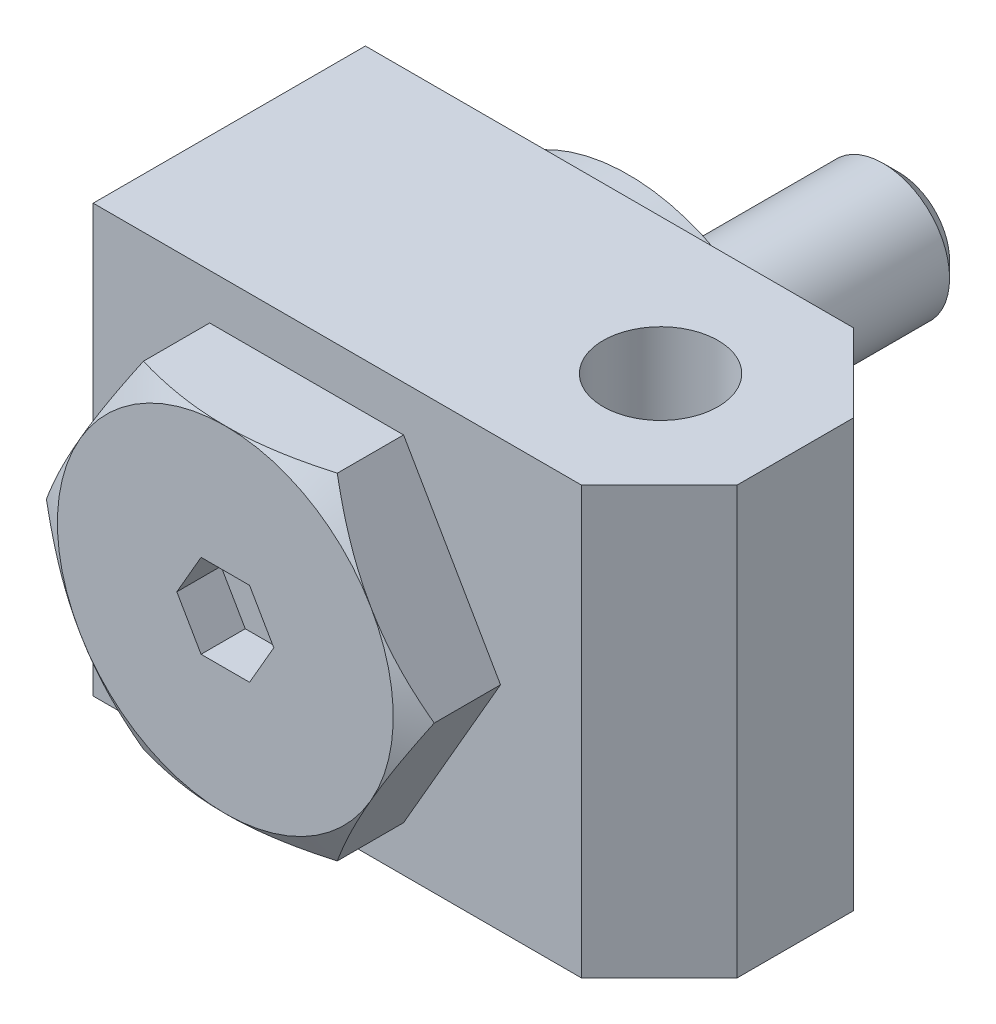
ISO-10303-21;
HEADER;
FILE_DESCRIPTION(('STEP AP214'),'2;1');
FILE_NAME('part.step','',(''),(''),'','','');
FILE_SCHEMA(('AUTOMOTIVE_DESIGN { 1 0 10303 214 1 1 1 1 }'));
ENDSEC;
DATA;
#1=APPLICATION_CONTEXT('core data for automotive mechanical design processes');
#2=APPLICATION_PROTOCOL_DEFINITION('international standard','automotive_design',2000,#1);
#3=PRODUCT_CONTEXT('',#1,'mechanical');
#4=PRODUCT('Part','Part','',(#3));
#5=PRODUCT_RELATED_PRODUCT_CATEGORY('part','',(#4));
#6=PRODUCT_DEFINITION_FORMATION('','',#4);
#7=PRODUCT_DEFINITION_CONTEXT('part definition',#1,'design');
#8=PRODUCT_DEFINITION('design','',#6,#7);
#9=PRODUCT_DEFINITION_SHAPE('','',#8);
#10=(LENGTH_UNIT() NAMED_UNIT(*) SI_UNIT(.MILLI.,.METRE.));
#11=(NAMED_UNIT(*) PLANE_ANGLE_UNIT() SI_UNIT($,.RADIAN.));
#12=(NAMED_UNIT(*) SI_UNIT($,.STERADIAN.) SOLID_ANGLE_UNIT());
#13=UNCERTAINTY_MEASURE_WITH_UNIT(LENGTH_MEASURE(1.E-05),#10,'distance_accuracy_value','');
#14=(GEOMETRIC_REPRESENTATION_CONTEXT(3) GLOBAL_UNCERTAINTY_ASSIGNED_CONTEXT((#13)) GLOBAL_UNIT_ASSIGNED_CONTEXT((#10,
#11,#12)) REPRESENTATION_CONTEXT('',''));
#15=CARTESIAN_POINT('',(0.,0.,0.));
#16=DIRECTION('',(0.,0.,1.));
#17=DIRECTION('',(1.,0.,0.));
#18=AXIS2_PLACEMENT_3D('',#15,#16,#17);
#19=CARTESIAN_POINT('',(43.8786204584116,0.,-61.497462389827));
#20=DIRECTION('',(0.866025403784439,0.5,0.));
#21=DIRECTION('',(-0.5,0.866025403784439,0.));
#22=AXIS2_PLACEMENT_3D('',#19,#20,#21);
#23=PLANE('',#22);
#24=DIRECTION('',(0.,0.,1.));
#25=VECTOR('',#24,1.);
#26=CARTESIAN_POINT('',(21.9393102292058,38.,-61.497462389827));
#27=LINE('',#26,#25);
#28=CARTESIAN_POINT('',(21.9393102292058,38.,72.8));
#29=VERTEX_POINT('',#28);
#30=CARTESIAN_POINT('',(21.9393102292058,38.,87.8059768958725));
#31=VERTEX_POINT('',#30);
#32=EDGE_CURVE('E419',#29,#31,#27,.T.);
#33=ORIENTED_EDGE('',*,*,#32,.T.);
#34=CARTESIAN_POINT('',(21.939194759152,38.0002,87.8059102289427));
#35=CARTESIAN_POINT('',(22.4214106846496,37.1649775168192,88.0842961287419));
#36=CARTESIAN_POINT('',(22.9055075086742,36.3264972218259,88.3500491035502));
#37=CARTESIAN_POINT('',(23.8775830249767,34.6428130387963,88.8527777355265));
#38=CARTESIAN_POINT('',(24.3655629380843,33.7976070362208,89.089743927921));
#39=CARTESIAN_POINT('',(25.3463581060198,32.0988199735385,89.5317183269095));
#40=CARTESIAN_POINT('',(25.8391820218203,31.245223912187,89.7366502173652));
#41=CARTESIAN_POINT('',(26.8282333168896,29.5321368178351,90.1101413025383));
#42=CARTESIAN_POINT('',(27.3244603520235,28.672646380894,90.2787041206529));
#43=CARTESIAN_POINT('',(28.3076339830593,26.969739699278,90.5723018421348));
#44=CARTESIAN_POINT('',(28.7945076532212,26.12644976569,90.698307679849));
#45=CARTESIAN_POINT('',(29.7704858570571,24.4360059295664,90.909590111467));
#46=CARTESIAN_POINT('',(30.2595904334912,23.5888519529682,90.9948659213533));
#47=CARTESIAN_POINT('',(31.2386211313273,21.8931210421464,91.1225351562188));
#48=CARTESIAN_POINT('',(31.728545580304,21.0445470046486,91.1649795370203));
#49=CARTESIAN_POINT('',(32.7088466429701,19.3466157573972,91.2060730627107));
#50=CARTESIAN_POINT('',(33.1992232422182,18.4972585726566,91.2047235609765));
#51=CARTESIAN_POINT('',(34.1159851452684,16.9093803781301,91.1612889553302));
#52=CARTESIAN_POINT('',(34.5424357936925,16.1707461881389,91.1245003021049));
#53=CARTESIAN_POINT('',(35.3943200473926,14.6952393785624,91.0185000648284));
#54=CARTESIAN_POINT('',(35.8197536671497,13.9583667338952,90.9492889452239));
#55=CARTESIAN_POINT('',(36.6694416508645,12.4866639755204,90.7796473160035));
#56=CARTESIAN_POINT('',(37.0936945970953,11.7518363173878,90.6791885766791));
#57=CARTESIAN_POINT('',(37.9401839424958,10.2856737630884,90.4488143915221));
#58=CARTESIAN_POINT('',(38.3624203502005,9.55433885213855,90.3188990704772));
#59=CARTESIAN_POINT('',(39.2138408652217,8.07963526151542,90.028493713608));
#60=CARTESIAN_POINT('',(39.6429725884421,7.33635731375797,89.867392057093));
#61=CARTESIAN_POINT('',(40.4986095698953,5.85435058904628,89.5189121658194));
#62=CARTESIAN_POINT('',(40.9251144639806,5.11562244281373,89.3315303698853));
#63=CARTESIAN_POINT('',(41.7744976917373,3.64444753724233,88.9333258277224));
#64=CARTESIAN_POINT('',(42.1973814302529,2.91199141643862,88.7225489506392));
#65=CARTESIAN_POINT('',(43.0402240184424,1.45214523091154,88.2796570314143));
#66=CARTESIAN_POINT('',(43.4601836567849,0.724753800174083,88.047548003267));
#67=CARTESIAN_POINT('',(43.8787359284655,-0.000200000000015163,87.8059102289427));
#68=B_SPLINE_CURVE_WITH_KNOTS('',3,(#34,#35,#36,#37,#38,#39,#40,#41,#42,#43,#44,#45,#46,#47,#48,
#49,#50,#51,#52,#53,#54,#55,#56,#57,#58,#59,#60,#61,#62,#63,#64,#65,#66,#67),.UNSPECIFIED.,.F.,
.F.,(4,2,2,2,2,2,2,2,2,2,2,2,2,2,2,2,4),(0.,3.01149830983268,6.02398410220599,9.0435406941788,
12.062796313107,15.0075935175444,17.9524474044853,20.8937937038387,23.8350491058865,
26.3955151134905,28.9559444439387,31.5186936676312,34.0814320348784,36.700742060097,
39.3204073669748,41.9350242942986,44.5489063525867),.UNSPECIFIED.);
#69=CARTESIAN_POINT('',(32.9089653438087,19.,91.2));
#70=VERTEX_POINT('',#69);
#71=EDGE_CURVE('E163',#31,#70,#68,.T.);
#72=ORIENTED_EDGE('',*,*,#71,.T.);
#73=CARTESIAN_POINT('',(43.8786204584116,0.,87.8059768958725));
#74=VERTEX_POINT('',#73);
#75=EDGE_CURVE('E30',#70,#74,#68,.T.);
#76=ORIENTED_EDGE('',*,*,#75,.T.);
#77=DIRECTION('',(0.,0.,1.));
#78=VECTOR('',#77,1.);
#79=CARTESIAN_POINT('',(43.8786204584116,0.,-61.497462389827));
#80=LINE('',#79,#78);
#81=CARTESIAN_POINT('',(43.8786204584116,0.,72.8));
#82=VERTEX_POINT('',#81);
#83=EDGE_CURVE('E421',#82,#74,#80,.T.);
#84=ORIENTED_EDGE('',*,*,#83,.F.);
#85=DIRECTION('',(0.5,-0.866025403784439,0.));
#86=VECTOR('',#85,1.);
#87=CARTESIAN_POINT('',(43.8786204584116,0.,72.8));
#88=LINE('',#87,#86);
#89=EDGE_CURVE('E399',#29,#82,#88,.T.);
#90=ORIENTED_EDGE('',*,*,#89,.F.);
#91=EDGE_LOOP('',(#33,#72,#76,#84,#90));
#92=FACE_BOUND('',#91,.T.);
#93=ADVANCED_FACE('F14',(#92),#23,.T.);
#94=CARTESIAN_POINT('',(21.9393102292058,38.,-61.497462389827));
#95=DIRECTION('',(0.,1.,0.));
#96=DIRECTION('',(0.,0.,1.));
#97=AXIS2_PLACEMENT_3D('',#94,#95,#96);
#98=PLANE('',#97);
#99=DIRECTION('',(0.,0.,1.));
#100=VECTOR('',#99,1.);
#101=CARTESIAN_POINT('',(-21.9393102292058,38.,-61.497462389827));
#102=LINE('',#101,#100);
#103=CARTESIAN_POINT('',(-21.9393102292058,38.,72.8));
#104=VERTEX_POINT('',#103);
#105=CARTESIAN_POINT('',(-21.9393102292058,38.,87.8059768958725));
#106=VERTEX_POINT('',#105);
#107=EDGE_CURVE('E187',#104,#106,#102,.T.);
#108=ORIENTED_EDGE('',*,*,#107,.T.);
#109=CARTESIAN_POINT('',(-58.7013917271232,38.,72.7666569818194));
#110=CARTESIAN_POINT('',(-57.8725386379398,38.,73.1683593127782));
#111=CARTESIAN_POINT('',(-57.042706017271,38.,73.5680473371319));
#112=CARTESIAN_POINT('',(-55.3808786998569,38.,74.3629239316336));
#113=CARTESIAN_POINT('',(-54.5488839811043,38.,74.7581124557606));
#114=CARTESIAN_POINT('',(-52.882415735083,38.,75.5435725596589));
#115=CARTESIAN_POINT('',(-52.0479418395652,38.,75.9338433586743));
#116=CARTESIAN_POINT('',(-50.3764266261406,38.,76.7088455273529));
#117=CARTESIAN_POINT('',(-49.5393853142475,38.,77.0935769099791));
#118=CARTESIAN_POINT('',(-47.8578628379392,38.,77.8589755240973));
#119=CARTESIAN_POINT('',(-47.013366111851,38.,78.2396085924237));
#120=CARTESIAN_POINT('',(-45.3212628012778,38.,78.9938969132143));
#121=CARTESIAN_POINT('',(-44.4736562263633,38.,79.3675521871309));
#122=CARTESIAN_POINT('',(-42.7750659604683,38.,80.1070276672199));
#123=CARTESIAN_POINT('',(-41.92408239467,38.,80.4728481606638));
#124=CARTESIAN_POINT('',(-40.218393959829,38.,81.1956945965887));
#125=CARTESIAN_POINT('',(-39.3636891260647,38.,81.5527206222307));
#126=CARTESIAN_POINT('',(-37.6231132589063,38.,82.2680010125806));
#127=CARTESIAN_POINT('',(-36.7371113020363,38.,82.6259372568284));
#128=CARTESIAN_POINT('',(-34.9603649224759,38.,83.3298624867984));
#129=CARTESIAN_POINT('',(-34.0696204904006,38.,83.6758514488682));
#130=CARTESIAN_POINT('',(-32.282854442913,38.,84.3543042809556));
#131=CARTESIAN_POINT('',(-31.3868321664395,38.,84.6867664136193));
#132=CARTESIAN_POINT('',(-29.5892065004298,38.,85.3362549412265));
#133=CARTESIAN_POINT('',(-28.6876031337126,38.,85.6532813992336));
#134=CARTESIAN_POINT('',(-26.8802643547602,38.,86.2691437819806));
#135=CARTESIAN_POINT('',(-25.9745414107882,38.,86.5680161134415));
#136=CARTESIAN_POINT('',(-24.156793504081,38.,87.1458799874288));
#137=CARTESIAN_POINT('',(-23.2447684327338,38.,87.4248711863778));
#138=CARTESIAN_POINT('',(-20.4992125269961,38.,88.2279574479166));
#139=CARTESIAN_POINT('',(-18.6555030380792,38.,88.7184071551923));
#140=CARTESIAN_POINT('',(-15.8751510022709,38.,89.3674222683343));
#141=CARTESIAN_POINT('',(-14.948415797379,38.,89.5688906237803));
#142=CARTESIAN_POINT('',(-13.0886486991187,38.,89.9405199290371));
#143=CARTESIAN_POINT('',(-12.1556169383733,38.,90.1106815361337));
#144=CARTESIAN_POINT('',(-10.2839430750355,38.,90.4166771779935));
#145=CARTESIAN_POINT('',(-9.34530113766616,38.,90.5525122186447));
#146=CARTESIAN_POINT('',(-7.46336642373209,38.,90.787144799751));
#147=CARTESIAN_POINT('',(-6.52007364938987,38.,90.8859423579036));
#148=CARTESIAN_POINT('',(-4.64242257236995,38.,91.0433031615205));
#149=CARTESIAN_POINT('',(-3.70810680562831,38.,91.1023709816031));
#150=CARTESIAN_POINT('',(-1.83781493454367,38.,91.1809571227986));
#151=CARTESIAN_POINT('',(-0.901838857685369,38.,91.2004760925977));
#152=CARTESIAN_POINT('',(0.970094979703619,38.,91.1995062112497));
#153=CARTESIAN_POINT('',(1.90605274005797,38.,91.1790170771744));
#154=CARTESIAN_POINT('',(3.77631093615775,38.,91.0985077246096));
#155=CARTESIAN_POINT('',(4.71061129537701,38.,91.0384857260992));
#156=CARTESIAN_POINT('',(6.30315397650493,38.,90.9034285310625));
#157=CARTESIAN_POINT('',(6.96222321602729,38.,90.8379171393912));
#158=CARTESIAN_POINT('',(8.27828390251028,38.,90.6885225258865));
#159=CARTESIAN_POINT('',(8.93527528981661,38.,90.6046387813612));
#160=CARTESIAN_POINT('',(10.9026304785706,38.,90.3266576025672));
#161=CARTESIAN_POINT('',(12.2093391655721,38.,90.106233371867));
#162=CARTESIAN_POINT('',(14.8115515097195,38.,89.6029817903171));
#163=CARTESIAN_POINT('',(16.1070454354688,38.,89.3201049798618));
#164=CARTESIAN_POINT('',(18.6849918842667,38.,88.7005770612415));
#165=CARTESIAN_POINT('',(19.9674446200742,38.,88.3639268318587));
#166=CARTESIAN_POINT('',(22.5472425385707,38.,87.6371372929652));
#167=CARTESIAN_POINT('',(23.8443019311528,38.,87.2459909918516));
#168=CARTESIAN_POINT('',(26.4256404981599,38.,86.4237990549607));
#169=CARTESIAN_POINT('',(27.7099195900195,38.,85.9927531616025));
#170=CARTESIAN_POINT('',(30.2663504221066,38.,85.0975597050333));
#171=CARTESIAN_POINT('',(31.5385061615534,38.,84.6334235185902));
#172=CARTESIAN_POINT('',(33.4388431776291,38.,83.9164490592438));
#173=CARTESIAN_POINT('',(34.0709730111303,38.,83.6739957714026));
#174=CARTESIAN_POINT('',(35.3327672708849,38.,83.1827455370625));
#175=CARTESIAN_POINT('',(35.9624316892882,38.,82.9339485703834));
#176=CARTESIAN_POINT('',(37.4181142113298,38.,82.3510001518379));
#177=CARTESIAN_POINT('',(38.2432829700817,38.,82.0147281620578));
#178=CARTESIAN_POINT('',(39.8899255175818,38.,81.3332472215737));
#179=CARTESIAN_POINT('',(40.7113992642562,38.,80.9880381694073));
#180=CARTESIAN_POINT('',(43.1708034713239,38.,79.9404600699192));
#181=CARTESIAN_POINT('',(44.8036595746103,38.,79.2261631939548));
#182=CARTESIAN_POINT('',(48.0582920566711,38.,77.7720077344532));
#183=CARTESIAN_POINT('',(49.6800661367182,38.,77.0321440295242));
#184=CARTESIAN_POINT('',(52.9140127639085,38.,75.5318351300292));
#185=CARTESIAN_POINT('',(54.5261854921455,38.,74.7713903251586));
#186=CARTESIAN_POINT('',(57.744102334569,38.,73.2328888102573));
#187=CARTESIAN_POINT('',(59.3498382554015,38.,72.4548149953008));
#188=CARTESIAN_POINT('',(62.5544866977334,38.,70.8847426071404));
#189=CARTESIAN_POINT('',(64.1533991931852,38.,70.0927439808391));
#190=CARTESIAN_POINT('',(67.3452383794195,38.,68.4972385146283));
#191=CARTESIAN_POINT('',(68.938165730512,38.,67.693732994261));
#192=CARTESIAN_POINT('',(72.1190596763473,38.,66.0769763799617));
#193=CARTESIAN_POINT('',(73.7070262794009,38.,65.2637253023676));
#194=CARTESIAN_POINT('',(76.7510592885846,38.,63.6947496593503));
#195=CARTESIAN_POINT('',(78.2074548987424,38.,62.9396632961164));
#196=CARTESIAN_POINT('',(81.1170987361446,38.,61.4234473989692));
#197=CARTESIAN_POINT('',(82.5703469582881,38.,60.6623178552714));
#198=CARTESIAN_POINT('',(85.4741214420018,38.,59.1347809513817));
#199=CARTESIAN_POINT('',(86.9246476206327,38.,58.3683734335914));
#200=CARTESIAN_POINT('',(89.8232616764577,38.,56.8309608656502));
#201=CARTESIAN_POINT('',(91.2713495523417,38.,56.05995581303));
#202=CARTESIAN_POINT('',(94.1619805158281,38.,54.5157117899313));
#203=CARTESIAN_POINT('',(95.6045286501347,38.,53.7424822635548));
#204=CARTESIAN_POINT('',(98.4877128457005,38.,52.1924661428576));
#205=CARTESIAN_POINT('',(99.9283489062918,38.,51.415679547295));
#206=CARTESIAN_POINT('',(102.807840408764,38.,49.8589910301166));
#207=CARTESIAN_POINT('',(104.246695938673,38.,49.0790892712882));
#208=CARTESIAN_POINT('',(107.122871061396,38.,47.5164638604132));
#209=CARTESIAN_POINT('',(108.560190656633,38.,46.7337402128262));
#210=CARTESIAN_POINT('',(109.996829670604,38.,45.949771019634));
#211=B_SPLINE_CURVE_WITH_KNOTS('',3,(#109,#110,#111,#112,#113,#114,#115,#116,#117,#118,#119,
#120,#121,#122,#123,#124,#125,#126,#127,#128,#129,#130,#131,#132,#133,#134,#135,#136,#137,#138,
#139,#140,#141,#142,#143,#144,#145,#146,#147,#148,#149,#150,#151,#152,#153,#154,#155,#156,#157,
#158,#159,#160,#161,#162,#163,#164,#165,#166,#167,#168,#169,#170,#171,#172,#173,#174,#175,#176,
#177,#178,#179,#180,#181,#182,#183,#184,#185,#186,#187,#188,#189,#190,#191,#192,#193,#194,#195,
#196,#197,#198,#199,#200,#201,#202,#203,#204,#205,#206,#207,#208,#209,#210),.UNSPECIFIED.,.F.,
.F.,(4,2,2,2,2,2,2,2,2,2,2,2,2,2,2,2,2,2,2,2,2,2,2,2,2,2,2,2,2,2,2,2,2,2,2,2,2,2,2,2,2,2,2,2,2,
2,2,2,2,2,4),(0.,2.76319907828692,5.52642639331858,8.29008701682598,11.053741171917,
13.8326527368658,16.6115557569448,19.3903567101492,22.1691313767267,25.0357705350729,
27.9024153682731,30.7694272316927,33.6364273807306,36.4974740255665,39.3585701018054,
45.0785479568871,47.9232677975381,50.7679279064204,53.6125046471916,56.4570800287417,
59.2648099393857,62.0724937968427,64.8801975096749,67.6880276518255,69.6747250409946,
71.6614789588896,75.6350954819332,79.6118702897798,83.5885801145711,87.6520764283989,
91.7155989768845,95.7777311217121,97.8087988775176,99.8398730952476,102.512981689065,
105.186120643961,110.532583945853,115.880124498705,121.227563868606,126.580434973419,
131.933326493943,137.285609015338,142.637882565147,147.559369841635,152.480865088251,
157.402507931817,162.324153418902,167.234286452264,172.144421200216,177.054302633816,
181.964176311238),.UNSPECIFIED.);
#212=CARTESIAN_POINT('',(0.,38.,91.2));
#213=VERTEX_POINT('',#212);
#214=EDGE_CURVE('E168',#106,#213,#211,.T.);
#215=ORIENTED_EDGE('',*,*,#214,.T.);
#216=EDGE_CURVE('E157',#213,#31,#211,.T.);
#217=ORIENTED_EDGE('',*,*,#216,.T.);
#218=ORIENTED_EDGE('',*,*,#32,.F.);
#219=DIRECTION('',(1.,0.,0.));
#220=VECTOR('',#219,1.);
#221=CARTESIAN_POINT('',(21.9393102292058,38.,72.8));
#222=LINE('',#221,#220);
#223=EDGE_CURVE('E427',#104,#29,#222,.T.);
#224=ORIENTED_EDGE('',*,*,#223,.F.);
#225=EDGE_LOOP('',(#108,#215,#217,#218,#224));
#226=FACE_BOUND('',#225,.T.);
#227=ADVANCED_FACE('F185',(#226),#98,.T.);
#228=CARTESIAN_POINT('',(-21.9393102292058,38.,-61.497462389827));
#229=DIRECTION('',(-0.866025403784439,0.5,0.));
#230=DIRECTION('',(-0.5,-0.866025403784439,0.));
#231=AXIS2_PLACEMENT_3D('',#228,#229,#230);
#232=PLANE('',#231);
#233=DIRECTION('',(0.,0.,1.));
#234=VECTOR('',#233,1.);
#235=CARTESIAN_POINT('',(-43.8786204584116,0.,-61.497462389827));
#236=LINE('',#235,#234);
#237=CARTESIAN_POINT('',(-43.8786204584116,0.,72.8));
#238=VERTEX_POINT('',#237);
#239=CARTESIAN_POINT('',(-43.8786204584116,0.,87.8059768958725));
#240=VERTEX_POINT('',#239);
#241=EDGE_CURVE('E415',#238,#240,#236,.T.);
#242=ORIENTED_EDGE('',*,*,#241,.T.);
#243=CARTESIAN_POINT('',(-43.8787359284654,-0.000199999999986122,87.8059102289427));
#244=CARTESIAN_POINT('',(-43.3965200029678,0.835022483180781,88.084296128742));
#245=CARTESIAN_POINT('',(-42.9124231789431,1.67350277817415,88.3500491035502));
#246=CARTESIAN_POINT('',(-41.9403476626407,3.35718696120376,88.8527777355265));
#247=CARTESIAN_POINT('',(-41.4523677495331,4.2023929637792,89.089743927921));
#248=CARTESIAN_POINT('',(-40.4715725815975,5.90118002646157,89.5317183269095));
#249=CARTESIAN_POINT('',(-39.9787486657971,6.75477608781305,89.7366502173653));
#250=CARTESIAN_POINT('',(-38.9896973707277,8.46786318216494,90.1101413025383));
#251=CARTESIAN_POINT('',(-38.4934703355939,9.327353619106,90.2787041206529));
#252=CARTESIAN_POINT('',(-37.5102967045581,11.030260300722,90.5723018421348));
#253=CARTESIAN_POINT('',(-37.0234230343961,11.87355023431,90.698307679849));
#254=CARTESIAN_POINT('',(-36.0474448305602,13.5639940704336,90.9095901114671));
#255=CARTESIAN_POINT('',(-35.5583402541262,14.4111480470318,90.9948659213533));
#256=CARTESIAN_POINT('',(-34.57930955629,16.1068789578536,91.1225351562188));
#257=CARTESIAN_POINT('',(-34.0893851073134,16.9554529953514,91.1649795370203));
#258=CARTESIAN_POINT('',(-33.1090840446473,18.6533842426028,91.2060730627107));
#259=CARTESIAN_POINT('',(-32.6187074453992,19.5027414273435,91.2047235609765));
#260=CARTESIAN_POINT('',(-31.701945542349,21.09061962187,91.1612889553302));
#261=CARTESIAN_POINT('',(-31.2754948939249,21.8292538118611,91.1245003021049));
#262=CARTESIAN_POINT('',(-30.4236106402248,23.3047606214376,91.0185000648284));
#263=CARTESIAN_POINT('',(-29.9981770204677,24.0416332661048,90.949288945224));
#264=CARTESIAN_POINT('',(-29.1484890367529,25.5133360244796,90.7796473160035));
#265=CARTESIAN_POINT('',(-28.7242360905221,26.2481636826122,90.6791885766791));
#266=CARTESIAN_POINT('',(-27.8777467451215,27.7143262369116,90.4488143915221));
#267=CARTESIAN_POINT('',(-27.4555103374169,28.4456611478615,90.3188990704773));
#268=CARTESIAN_POINT('',(-26.6040898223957,29.9203647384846,90.028493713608));
#269=CARTESIAN_POINT('',(-26.1749580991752,30.663642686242,89.867392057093));
#270=CARTESIAN_POINT('',(-25.3193211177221,32.1456494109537,89.5189121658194));
#271=CARTESIAN_POINT('',(-24.8928162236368,32.8843775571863,89.3315303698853));
#272=CARTESIAN_POINT('',(-24.0434329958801,34.3555524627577,88.9333258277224));
#273=CARTESIAN_POINT('',(-23.6205492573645,35.0880085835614,88.7225489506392));
#274=CARTESIAN_POINT('',(-22.777706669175,36.5478547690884,88.2796570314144));
#275=CARTESIAN_POINT('',(-22.3577470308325,37.2752461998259,88.047548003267));
#276=CARTESIAN_POINT('',(-21.939194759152,38.0002,87.8059102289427));
#277=B_SPLINE_CURVE_WITH_KNOTS('',3,(#243,#244,#245,#246,#247,#248,#249,#250,#251,#252,#253,
#254,#255,#256,#257,#258,#259,#260,#261,#262,#263,#264,#265,#266,#267,#268,#269,#270,#271,#272,
#273,#274,#275,#276),.UNSPECIFIED.,.F.,.F.,(4,2,2,2,2,2,2,2,2,2,2,2,2,2,2,2,4),(0.,
3.01149830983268,6.023984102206,9.04354069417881,12.062796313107,15.0075935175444,
17.9524474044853,20.8937937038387,23.8350491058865,26.3955151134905,28.9559444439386,
31.5186936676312,34.0814320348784,36.700742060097,39.3204073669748,41.9350242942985,
44.5489063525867),.UNSPECIFIED.);
#278=CARTESIAN_POINT('',(-32.9089653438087,19.,91.2));
#279=VERTEX_POINT('',#278);
#280=EDGE_CURVE('E474',#240,#279,#277,.T.);
#281=ORIENTED_EDGE('',*,*,#280,.T.);
#282=EDGE_CURVE('E176',#279,#106,#277,.T.);
#283=ORIENTED_EDGE('',*,*,#282,.T.);
#284=ORIENTED_EDGE('',*,*,#107,.F.);
#285=DIRECTION('',(0.5,0.866025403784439,0.));
#286=VECTOR('',#285,1.);
#287=CARTESIAN_POINT('',(-21.9393102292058,38.,72.8));
#288=LINE('',#287,#286);
#289=EDGE_CURVE('E462',#238,#104,#288,.T.);
#290=ORIENTED_EDGE('',*,*,#289,.F.);
#291=EDGE_LOOP('',(#242,#281,#283,#284,#290));
#292=FACE_BOUND('',#291,.T.);
#293=ADVANCED_FACE('F473',(#292),#232,.T.);
#294=CARTESIAN_POINT('',(-43.8786204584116,0.,-61.497462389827));
#295=DIRECTION('',(-0.866025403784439,-0.5,0.));
#296=DIRECTION('',(0.5,-0.866025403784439,0.));
#297=AXIS2_PLACEMENT_3D('',#294,#295,#296);
#298=PLANE('',#297);
#299=DIRECTION('',(0.,0.,1.));
#300=VECTOR('',#299,1.);
#301=CARTESIAN_POINT('',(-21.9393102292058,-38.,-61.497462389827));
#302=LINE('',#301,#300);
#303=CARTESIAN_POINT('',(-21.9393102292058,-38.,72.8));
#304=VERTEX_POINT('',#303);
#305=CARTESIAN_POINT('',(-21.9393102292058,-38.,87.8059768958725));
#306=VERTEX_POINT('',#305);
#307=EDGE_CURVE('E400',#304,#306,#302,.T.);
#308=ORIENTED_EDGE('',*,*,#307,.T.);
#309=CARTESIAN_POINT('',(-21.939194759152,-38.0002,87.8059102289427));
#310=CARTESIAN_POINT('',(-22.4214106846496,-37.1649775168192,88.0842961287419));
#311=CARTESIAN_POINT('',(-22.9055075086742,-36.3264972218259,88.3500491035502));
#312=CARTESIAN_POINT('',(-23.8775830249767,-34.6428130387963,88.8527777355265));
#313=CARTESIAN_POINT('',(-24.3655629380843,-33.7976070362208,89.089743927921));
#314=CARTESIAN_POINT('',(-25.3463581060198,-32.0988199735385,89.5317183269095));
#315=CARTESIAN_POINT('',(-25.8391820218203,-31.245223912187,89.7366502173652));
#316=CARTESIAN_POINT('',(-26.8282333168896,-29.5321368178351,90.1101413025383));
#317=CARTESIAN_POINT('',(-27.3244603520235,-28.672646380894,90.2787041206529));
#318=CARTESIAN_POINT('',(-28.3076339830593,-26.969739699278,90.5723018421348));
#319=CARTESIAN_POINT('',(-28.7945076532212,-26.12644976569,90.698307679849));
#320=CARTESIAN_POINT('',(-29.7704858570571,-24.4360059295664,90.909590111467));
#321=CARTESIAN_POINT('',(-30.2595904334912,-23.5888519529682,90.9948659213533));
#322=CARTESIAN_POINT('',(-31.2386211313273,-21.8931210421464,91.1225351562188));
#323=CARTESIAN_POINT('',(-31.728545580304,-21.0445470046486,91.1649795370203));
#324=CARTESIAN_POINT('',(-32.7088466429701,-19.3466157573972,91.2060730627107));
#325=CARTESIAN_POINT('',(-33.1992232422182,-18.4972585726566,91.2047235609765));
#326=CARTESIAN_POINT('',(-34.1159851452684,-16.9093803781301,91.1612889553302));
#327=CARTESIAN_POINT('',(-34.5424357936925,-16.1707461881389,91.1245003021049));
#328=CARTESIAN_POINT('',(-35.3943200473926,-14.6952393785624,91.0185000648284));
#329=CARTESIAN_POINT('',(-35.8197536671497,-13.9583667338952,90.9492889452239));
#330=CARTESIAN_POINT('',(-36.6694416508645,-12.4866639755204,90.7796473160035));
#331=CARTESIAN_POINT('',(-37.0936945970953,-11.7518363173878,90.6791885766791));
#332=CARTESIAN_POINT('',(-37.9401839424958,-10.2856737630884,90.4488143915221));
#333=CARTESIAN_POINT('',(-38.3624203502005,-9.55433885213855,90.3188990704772));
#334=CARTESIAN_POINT('',(-39.2138408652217,-8.07963526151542,90.028493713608));
#335=CARTESIAN_POINT('',(-39.6429725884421,-7.33635731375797,89.867392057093));
#336=CARTESIAN_POINT('',(-40.4986095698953,-5.85435058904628,89.5189121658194));
#337=CARTESIAN_POINT('',(-40.9251144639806,-5.11562244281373,89.3315303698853));
#338=CARTESIAN_POINT('',(-41.7744976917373,-3.64444753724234,88.9333258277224));
#339=CARTESIAN_POINT('',(-42.1973814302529,-2.91199141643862,88.7225489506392));
#340=CARTESIAN_POINT('',(-43.0402240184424,-1.45214523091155,88.2796570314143));
#341=CARTESIAN_POINT('',(-43.4601836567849,-0.724753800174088,88.047548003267));
#342=CARTESIAN_POINT('',(-43.8787359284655,0.000200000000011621,87.8059102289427));
#343=B_SPLINE_CURVE_WITH_KNOTS('',3,(#309,#310,#311,#312,#313,#314,#315,#316,#317,#318,#319,
#320,#321,#322,#323,#324,#325,#326,#327,#328,#329,#330,#331,#332,#333,#334,#335,#336,#337,#338,
#339,#340,#341,#342),.UNSPECIFIED.,.F.,.F.,(4,2,2,2,2,2,2,2,2,2,2,2,2,2,2,2,4),(0.,
3.01149830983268,6.02398410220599,9.0435406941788,12.062796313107,15.0075935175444,
17.9524474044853,20.8937937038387,23.8350491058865,26.3955151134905,28.9559444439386,
31.5186936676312,34.0814320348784,36.700742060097,39.3204073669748,41.9350242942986,
44.5489063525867),.UNSPECIFIED.);
#344=CARTESIAN_POINT('',(-32.9089653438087,-19.,91.2));
#345=VERTEX_POINT('',#344);
#346=EDGE_CURVE('E169',#306,#345,#343,.T.);
#347=ORIENTED_EDGE('',*,*,#346,.T.);
#348=EDGE_CURVE('E188',#345,#240,#343,.T.);
#349=ORIENTED_EDGE('',*,*,#348,.T.);
#350=ORIENTED_EDGE('',*,*,#241,.F.);
#351=DIRECTION('',(-0.5,0.866025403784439,0.));
#352=VECTOR('',#351,1.);
#353=CARTESIAN_POINT('',(-43.8786204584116,0.,72.8));
#354=LINE('',#353,#352);
#355=EDGE_CURVE('E409',#304,#238,#354,.T.);
#356=ORIENTED_EDGE('',*,*,#355,.F.);
#357=EDGE_LOOP('',(#308,#347,#349,#350,#356));
#358=FACE_BOUND('',#357,.T.);
#359=ADVANCED_FACE('F471',(#358),#298,.T.);
#360=CARTESIAN_POINT('',(-21.9393102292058,-38.,-61.497462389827));
#361=DIRECTION('',(0.,-1.,0.));
#362=DIRECTION('',(1.,0.,0.));
#363=AXIS2_PLACEMENT_3D('',#360,#361,#362);
#364=PLANE('',#363);
#365=DIRECTION('',(0.,0.,1.));
#366=VECTOR('',#365,1.);
#367=CARTESIAN_POINT('',(21.9393102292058,-38.,-61.497462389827));
#368=LINE('',#367,#366);
#369=CARTESIAN_POINT('',(21.9393102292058,-38.,72.8));
#370=VERTEX_POINT('',#369);
#371=CARTESIAN_POINT('',(21.9393102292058,-38.,87.8059768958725));
#372=VERTEX_POINT('',#371);
#373=EDGE_CURVE('E393',#370,#372,#368,.T.);
#374=ORIENTED_EDGE('',*,*,#373,.T.);
#375=CARTESIAN_POINT('',(-58.7013917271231,-38.,72.7666569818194));
#376=CARTESIAN_POINT('',(-57.8725386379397,-38.,73.1683593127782));
#377=CARTESIAN_POINT('',(-57.042706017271,-38.,73.5680473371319));
#378=CARTESIAN_POINT('',(-55.3808786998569,-38.,74.3629239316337));
#379=CARTESIAN_POINT('',(-54.5488839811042,-38.,74.7581124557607));
#380=CARTESIAN_POINT('',(-52.882415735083,-38.,75.543572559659));
#381=CARTESIAN_POINT('',(-52.0479418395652,-38.,75.9338433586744));
#382=CARTESIAN_POINT('',(-50.3764266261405,-38.,76.7088455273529));
#383=CARTESIAN_POINT('',(-49.5393853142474,-38.,77.0935769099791));
#384=CARTESIAN_POINT('',(-47.8578628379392,-38.,77.8589755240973));
#385=CARTESIAN_POINT('',(-47.0133661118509,-38.,78.2396085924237));
#386=CARTESIAN_POINT('',(-45.3212628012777,-38.,78.9938969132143));
#387=CARTESIAN_POINT('',(-44.4736562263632,-38.,79.367552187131));
#388=CARTESIAN_POINT('',(-42.7750659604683,-38.,80.1070276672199));
#389=CARTESIAN_POINT('',(-41.92408239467,-38.,80.4728481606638));
#390=CARTESIAN_POINT('',(-40.2183939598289,-38.,81.1956945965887));
#391=CARTESIAN_POINT('',(-39.3636891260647,-38.,81.5527206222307));
#392=CARTESIAN_POINT('',(-37.6231132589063,-38.,82.2680010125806));
#393=CARTESIAN_POINT('',(-36.7371113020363,-38.,82.6259372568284));
#394=CARTESIAN_POINT('',(-34.9603649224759,-38.,83.3298624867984));
#395=CARTESIAN_POINT('',(-34.0696204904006,-38.,83.6758514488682));
#396=CARTESIAN_POINT('',(-32.282854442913,-38.,84.3543042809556));
#397=CARTESIAN_POINT('',(-31.3868321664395,-38.,84.6867664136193));
#398=CARTESIAN_POINT('',(-29.5892065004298,-38.,85.3362549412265));
#399=CARTESIAN_POINT('',(-28.6876031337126,-38.,85.6532813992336));
#400=CARTESIAN_POINT('',(-26.8802643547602,-38.,86.2691437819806));
#401=CARTESIAN_POINT('',(-25.9745414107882,-38.,86.5680161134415));
#402=CARTESIAN_POINT('',(-24.156793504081,-38.,87.1458799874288));
#403=CARTESIAN_POINT('',(-23.2447684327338,-38.,87.4248711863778));
#404=CARTESIAN_POINT('',(-20.4992125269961,-38.,88.2279574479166));
#405=CARTESIAN_POINT('',(-18.6555030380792,-38.,88.7184071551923));
#406=CARTESIAN_POINT('',(-15.8751510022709,-38.,89.3674222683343));
#407=CARTESIAN_POINT('',(-14.948415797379,-38.,89.5688906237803));
#408=CARTESIAN_POINT('',(-13.0886486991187,-38.,89.9405199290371));
#409=CARTESIAN_POINT('',(-12.1556169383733,-38.,90.1106815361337));
#410=CARTESIAN_POINT('',(-10.2839430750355,-38.,90.4166771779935));
#411=CARTESIAN_POINT('',(-9.34530113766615,-38.,90.5525122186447));
#412=CARTESIAN_POINT('',(-7.46336642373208,-38.,90.787144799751));
#413=CARTESIAN_POINT('',(-6.52007364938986,-38.,90.8859423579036));
#414=CARTESIAN_POINT('',(-4.64242257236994,-38.,91.0433031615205));
#415=CARTESIAN_POINT('',(-3.7081068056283,-38.,91.1023709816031));
#416=CARTESIAN_POINT('',(-1.83781493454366,-38.,91.1809571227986));
#417=CARTESIAN_POINT('',(-0.901838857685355,-38.,91.2004760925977));
#418=CARTESIAN_POINT('',(0.970094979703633,-38.,91.1995062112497));
#419=CARTESIAN_POINT('',(1.90605274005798,-38.,91.1790170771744));
#420=CARTESIAN_POINT('',(3.77631093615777,-38.,91.0985077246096));
#421=CARTESIAN_POINT('',(4.71061129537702,-38.,91.0384857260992));
#422=CARTESIAN_POINT('',(6.30315397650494,-38.,90.9034285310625));
#423=CARTESIAN_POINT('',(6.96222321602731,-38.,90.8379171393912));
#424=CARTESIAN_POINT('',(8.2782839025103,-38.,90.6885225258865));
#425=CARTESIAN_POINT('',(8.93527528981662,-38.,90.6046387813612));
#426=CARTESIAN_POINT('',(10.9026304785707,-38.,90.3266576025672));
#427=CARTESIAN_POINT('',(12.2093391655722,-38.,90.106233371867));
#428=CARTESIAN_POINT('',(14.8115515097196,-38.,89.6029817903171));
#429=CARTESIAN_POINT('',(16.1070454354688,-38.,89.3201049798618));
#430=CARTESIAN_POINT('',(18.6849918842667,-38.,88.7005770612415));
#431=CARTESIAN_POINT('',(19.9674446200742,-38.,88.3639268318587));
#432=CARTESIAN_POINT('',(22.5472425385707,-38.,87.6371372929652));
#433=CARTESIAN_POINT('',(23.8443019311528,-38.,87.2459909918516));
#434=CARTESIAN_POINT('',(26.4256404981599,-38.,86.4237990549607));
#435=CARTESIAN_POINT('',(27.7099195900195,-38.,85.9927531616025));
#436=CARTESIAN_POINT('',(30.2663504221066,-38.,85.0975597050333));
#437=CARTESIAN_POINT('',(31.5385061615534,-38.,84.6334235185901));
#438=CARTESIAN_POINT('',(33.4388431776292,-38.,83.9164490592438));
#439=CARTESIAN_POINT('',(34.0709730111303,-38.,83.6739957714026));
#440=CARTESIAN_POINT('',(35.3327672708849,-38.,83.1827455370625));
#441=CARTESIAN_POINT('',(35.9624316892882,-38.,82.9339485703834));
#442=CARTESIAN_POINT('',(37.4181142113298,-38.,82.3510001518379));
#443=CARTESIAN_POINT('',(38.2432829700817,-38.,82.0147281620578));
#444=CARTESIAN_POINT('',(39.8899255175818,-38.,81.3332472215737));
#445=CARTESIAN_POINT('',(40.7113992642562,-38.,80.9880381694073));
#446=CARTESIAN_POINT('',(43.1708034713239,-38.,79.9404600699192));
#447=CARTESIAN_POINT('',(44.8036595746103,-38.,79.2261631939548));
#448=CARTESIAN_POINT('',(48.0582920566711,-38.,77.7720077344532));
#449=CARTESIAN_POINT('',(49.6800661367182,-38.,77.0321440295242));
#450=CARTESIAN_POINT('',(52.9140127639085,-38.,75.5318351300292));
#451=CARTESIAN_POINT('',(54.5261854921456,-38.,74.7713903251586));
#452=CARTESIAN_POINT('',(57.744102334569,-38.,73.2328888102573));
#453=CARTESIAN_POINT('',(59.3498382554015,-38.,72.4548149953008));
#454=CARTESIAN_POINT('',(62.5544866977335,-38.,70.8847426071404));
#455=CARTESIAN_POINT('',(64.1533991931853,-38.,70.0927439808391));
#456=CARTESIAN_POINT('',(67.3452383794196,-38.,68.4972385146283));
#457=CARTESIAN_POINT('',(68.938165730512,-38.,67.693732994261));
#458=CARTESIAN_POINT('',(72.1190596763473,-38.,66.0769763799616));
#459=CARTESIAN_POINT('',(73.7070262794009,-38.,65.2637253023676));
#460=CARTESIAN_POINT('',(76.7510592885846,-38.,63.6947496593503));
#461=CARTESIAN_POINT('',(78.2074548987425,-38.,62.9396632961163));
#462=CARTESIAN_POINT('',(81.1170987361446,-38.,61.4234473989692));
#463=CARTESIAN_POINT('',(82.5703469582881,-38.,60.6623178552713));
#464=CARTESIAN_POINT('',(85.4741214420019,-38.,59.1347809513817));
#465=CARTESIAN_POINT('',(86.9246476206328,-38.,58.3683734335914));
#466=CARTESIAN_POINT('',(89.8232616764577,-38.,56.8309608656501));
#467=CARTESIAN_POINT('',(91.2713495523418,-38.,56.05995581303));
#468=CARTESIAN_POINT('',(94.1619805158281,-38.,54.5157117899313));
#469=CARTESIAN_POINT('',(95.6045286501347,-38.,53.7424822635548));
#470=CARTESIAN_POINT('',(98.4877128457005,-38.,52.1924661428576));
#471=CARTESIAN_POINT('',(99.9283489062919,-38.,51.415679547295));
#472=CARTESIAN_POINT('',(102.807840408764,-38.,49.8589910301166));
#473=CARTESIAN_POINT('',(104.246695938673,-38.,49.0790892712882));
#474=CARTESIAN_POINT('',(107.122871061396,-38.,47.5164638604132));
#475=CARTESIAN_POINT('',(108.560190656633,-38.,46.7337402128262));
#476=CARTESIAN_POINT('',(109.996829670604,-38.,45.949771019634));
#477=B_SPLINE_CURVE_WITH_KNOTS('',3,(#375,#376,#377,#378,#379,#380,#381,#382,#383,#384,#385,
#386,#387,#388,#389,#390,#391,#392,#393,#394,#395,#396,#397,#398,#399,#400,#401,#402,#403,#404,
#405,#406,#407,#408,#409,#410,#411,#412,#413,#414,#415,#416,#417,#418,#419,#420,#421,#422,#423,
#424,#425,#426,#427,#428,#429,#430,#431,#432,#433,#434,#435,#436,#437,#438,#439,#440,#441,#442,
#443,#444,#445,#446,#447,#448,#449,#450,#451,#452,#453,#454,#455,#456,#457,#458,#459,#460,#461,
#462,#463,#464,#465,#466,#467,#468,#469,#470,#471,#472,#473,#474,#475,#476),.UNSPECIFIED.,.F.,
.F.,(4,2,2,2,2,2,2,2,2,2,2,2,2,2,2,2,2,2,2,2,2,2,2,2,2,2,2,2,2,2,2,2,2,2,2,2,2,2,2,2,2,2,2,2,2,
2,2,2,2,2,4),(0.,2.7631990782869,5.52642639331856,8.29008701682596,11.053741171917,
13.8326527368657,16.6115557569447,19.3903567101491,22.1691313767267,25.0357705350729,
27.9024153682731,30.7694272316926,33.6364273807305,36.4974740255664,39.3585701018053,
45.078547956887,47.923267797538,50.7679279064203,53.6125046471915,56.4570800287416,
59.2648099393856,62.0724937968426,64.8801975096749,67.6880276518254,69.6747250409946,
71.6614789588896,75.6350954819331,79.6118702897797,83.588580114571,87.6520764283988,
91.7155989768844,95.777731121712,97.8087988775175,99.8398730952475,102.512981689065,
105.186120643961,110.532583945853,115.880124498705,121.227563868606,126.580434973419,
131.933326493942,137.285609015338,142.637882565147,147.559369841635,152.480865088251,
157.402507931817,162.324153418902,167.234286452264,172.144421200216,177.054302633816,
181.964176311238),.UNSPECIFIED.);
#478=CARTESIAN_POINT('',(0.,-38.,91.2));
#479=VERTEX_POINT('',#478);
#480=EDGE_CURVE('E235',#372,#479,#477,.F.);
#481=ORIENTED_EDGE('',*,*,#480,.T.);
#482=EDGE_CURVE('E380',#479,#306,#477,.F.);
#483=ORIENTED_EDGE('',*,*,#482,.T.);
#484=ORIENTED_EDGE('',*,*,#307,.F.);
#485=DIRECTION('',(-1.,0.,0.));
#486=VECTOR('',#485,1.);
#487=CARTESIAN_POINT('',(-21.9393102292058,-38.,72.8));
#488=LINE('',#487,#486);
#489=EDGE_CURVE('E406',#370,#304,#488,.T.);
#490=ORIENTED_EDGE('',*,*,#489,.F.);
#491=EDGE_LOOP('',(#374,#481,#483,#484,#490));
#492=FACE_BOUND('',#491,.T.);
#493=ADVANCED_FACE('F254',(#492),#364,.T.);
#494=CARTESIAN_POINT('',(21.9393102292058,-38.,-61.497462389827));
#495=DIRECTION('',(0.866025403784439,-0.5,0.));
#496=DIRECTION('',(0.5,0.866025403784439,0.));
#497=AXIS2_PLACEMENT_3D('',#494,#495,#496);
#498=PLANE('',#497);
#499=ORIENTED_EDGE('',*,*,#83,.T.);
#500=CARTESIAN_POINT('',(43.8787359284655,0.000199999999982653,87.8059102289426));
#501=CARTESIAN_POINT('',(43.3965200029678,-0.835022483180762,88.0842961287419));
#502=CARTESIAN_POINT('',(42.9124231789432,-1.67350277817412,88.3500491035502));
#503=CARTESIAN_POINT('',(41.9403476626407,-3.35718696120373,88.8527777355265));
#504=CARTESIAN_POINT('',(41.4523677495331,-4.20239296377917,89.089743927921));
#505=CARTESIAN_POINT('',(40.4715725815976,-5.90118002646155,89.5317183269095));
#506=CARTESIAN_POINT('',(39.9787486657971,-6.75477608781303,89.7366502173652));
#507=CARTESIAN_POINT('',(38.9896973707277,-8.46786318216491,90.1101413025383));
#508=CARTESIAN_POINT('',(38.4934703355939,-9.32735361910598,90.2787041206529));
#509=CARTESIAN_POINT('',(37.5102967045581,-11.030260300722,90.5723018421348));
#510=CARTESIAN_POINT('',(37.0234230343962,-11.87355023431,90.698307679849));
#511=CARTESIAN_POINT('',(36.0474448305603,-13.5639940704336,90.909590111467));
#512=CARTESIAN_POINT('',(35.5583402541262,-14.4111480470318,90.9948659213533));
#513=CARTESIAN_POINT('',(34.57930955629,-16.1068789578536,91.1225351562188));
#514=CARTESIAN_POINT('',(34.0893851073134,-16.9554529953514,91.1649795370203));
#515=CARTESIAN_POINT('',(33.1090840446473,-18.6533842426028,91.2060730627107));
#516=CARTESIAN_POINT('',(32.6187074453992,-19.5027414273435,91.2047235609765));
#517=CARTESIAN_POINT('',(31.701945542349,-21.09061962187,91.1612889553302));
#518=CARTESIAN_POINT('',(31.2754948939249,-21.8292538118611,91.1245003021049));
#519=CARTESIAN_POINT('',(30.4236106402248,-23.3047606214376,91.0185000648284));
#520=CARTESIAN_POINT('',(29.9981770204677,-24.0416332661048,90.949288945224));
#521=CARTESIAN_POINT('',(29.1484890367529,-25.5133360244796,90.7796473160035));
#522=CARTESIAN_POINT('',(28.7242360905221,-26.2481636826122,90.6791885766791));
#523=CARTESIAN_POINT('',(27.8777467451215,-27.7143262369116,90.4488143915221));
#524=CARTESIAN_POINT('',(27.4555103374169,-28.4456611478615,90.3188990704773));
#525=CARTESIAN_POINT('',(26.6040898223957,-29.9203647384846,90.028493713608));
#526=CARTESIAN_POINT('',(26.1749580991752,-30.663642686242,89.867392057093));
#527=CARTESIAN_POINT('',(25.3193211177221,-32.1456494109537,89.5189121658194));
#528=CARTESIAN_POINT('',(24.8928162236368,-32.8843775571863,89.3315303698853));
#529=CARTESIAN_POINT('',(24.0434329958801,-34.3555524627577,88.9333258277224));
#530=CARTESIAN_POINT('',(23.6205492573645,-35.0880085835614,88.7225489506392));
#531=CARTESIAN_POINT('',(22.777706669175,-36.5478547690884,88.2796570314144));
#532=CARTESIAN_POINT('',(22.3577470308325,-37.2752461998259,88.047548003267));
#533=CARTESIAN_POINT('',(21.939194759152,-38.0002,87.8059102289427));
#534=B_SPLINE_CURVE_WITH_KNOTS('',3,(#500,#501,#502,#503,#504,#505,#506,#507,#508,#509,#510,
#511,#512,#513,#514,#515,#516,#517,#518,#519,#520,#521,#522,#523,#524,#525,#526,#527,#528,#529,
#530,#531,#532,#533),.UNSPECIFIED.,.F.,.F.,(4,2,2,2,2,2,2,2,2,2,2,2,2,2,2,2,4),(0.,
3.01149830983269,6.02398410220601,9.04354069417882,12.062796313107,15.0075935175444,
17.9524474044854,20.8937937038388,23.8350491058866,26.3955151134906,28.9559444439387,
31.5186936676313,34.0814320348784,36.700742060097,39.3204073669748,41.9350242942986,
44.5489063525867),.UNSPECIFIED.);
#535=CARTESIAN_POINT('',(32.9089653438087,-19.,91.2));
#536=VERTEX_POINT('',#535);
#537=EDGE_CURVE('E394',#74,#536,#534,.T.);
#538=ORIENTED_EDGE('',*,*,#537,.T.);
#539=EDGE_CURVE('E37',#536,#372,#534,.T.);
#540=ORIENTED_EDGE('',*,*,#539,.T.);
#541=ORIENTED_EDGE('',*,*,#373,.F.);
#542=DIRECTION('',(-0.5,-0.866025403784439,0.));
#543=VECTOR('',#542,1.);
#544=CARTESIAN_POINT('',(21.9393102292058,-38.,72.8));
#545=LINE('',#544,#543);
#546=EDGE_CURVE('E397',#82,#370,#545,.T.);
#547=ORIENTED_EDGE('',*,*,#546,.F.);
#548=EDGE_LOOP('',(#499,#538,#540,#541,#547));
#549=FACE_BOUND('',#548,.T.);
#550=ADVANCED_FACE('F249',(#549),#498,.T.);
#551=CARTESIAN_POINT('',(79.8,48.3,72.8));
#552=DIRECTION('',(0.,-1.,0.));
#553=DIRECTION('',(1.,0.,0.));
#554=AXIS2_PLACEMENT_3D('',#551,#552,#553);
#555=PLANE('',#554);
#556=CARTESIAN_POINT('',(49.3,48.3,42.));
#557=DIRECTION('',(0.,-1.,0.));
#558=DIRECTION('',(1.,0.,0.));
#559=AXIS2_PLACEMENT_3D('',#556,#557,#558);
#560=CIRCLE('',#559,13.);
#561=CARTESIAN_POINT('',(62.3,48.3,42.));
#562=VERTEX_POINT('',#561);
#563=EDGE_CURVE('E390',#562,#562,#560,.T.);
#564=ORIENTED_EDGE('',*,*,#563,.T.);
#565=EDGE_LOOP('',(#564));
#566=FACE_BOUND('',#565,.T.);
#567=DIRECTION('',(0.,0.,-1.));
#568=VECTOR('',#567,1.);
#569=CARTESIAN_POINT('',(-48.3,48.3,72.8));
#570=LINE('',#569,#568);
#571=CARTESIAN_POINT('',(-48.3,48.3,72.8));
#572=VERTEX_POINT('',#571);
#573=CARTESIAN_POINT('',(-48.3,48.3,11.2));
#574=VERTEX_POINT('',#573);
#575=EDGE_CURVE('E316',#572,#574,#570,.T.);
#576=ORIENTED_EDGE('',*,*,#575,.F.);
#577=DIRECTION('',(-1.,0.,0.));
#578=VECTOR('',#577,1.);
#579=CARTESIAN_POINT('',(79.8,48.3,72.8));
#580=LINE('',#579,#578);
#581=CARTESIAN_POINT('',(62.2,48.3,72.8));
#582=VERTEX_POINT('',#581);
#583=EDGE_CURVE('E431',#582,#572,#580,.T.);
#584=ORIENTED_EDGE('',*,*,#583,.F.);
#585=DIRECTION('',(0.707106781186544,0.,-0.707106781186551));
#586=VECTOR('',#585,1.);
#587=CARTESIAN_POINT('',(62.2,48.3,72.8));
#588=LINE('',#587,#586);
#589=CARTESIAN_POINT('',(79.8,48.3,55.2));
#590=VERTEX_POINT('',#589);
#591=EDGE_CURVE('E329',#582,#590,#588,.T.);
#592=ORIENTED_EDGE('',*,*,#591,.T.);
#593=DIRECTION('',(0.,0.,-1.));
#594=VECTOR('',#593,1.);
#595=CARTESIAN_POINT('',(79.8,48.3,72.8));
#596=LINE('',#595,#594);
#597=CARTESIAN_POINT('',(79.8,48.3,28.8000000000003));
#598=VERTEX_POINT('',#597);
#599=EDGE_CURVE('E437',#590,#598,#596,.T.);
#600=ORIENTED_EDGE('',*,*,#599,.T.);
#601=DIRECTION('',(0.707106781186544,0.,0.707106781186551));
#602=VECTOR('',#601,1.);
#603=CARTESIAN_POINT('',(79.8,48.3,28.8));
#604=LINE('',#603,#602);
#605=CARTESIAN_POINT('',(62.2,48.3,11.2));
#606=VERTEX_POINT('',#605);
#607=EDGE_CURVE('E327',#598,#606,#604,.F.);
#608=ORIENTED_EDGE('',*,*,#607,.T.);
#609=DIRECTION('',(-1.,0.,0.));
#610=VECTOR('',#609,1.);
#611=CARTESIAN_POINT('',(79.8,48.3,11.2));
#612=LINE('',#611,#610);
#613=EDGE_CURVE('E424',#606,#574,#612,.T.);
#614=ORIENTED_EDGE('',*,*,#613,.T.);
#615=EDGE_LOOP('',(#576,#584,#592,#600,#608,#614));
#616=FACE_BOUND('',#615,.T.);
#617=ADVANCED_FACE('F253',(#566,#616),#555,.F.);
#618=CARTESIAN_POINT('',(79.8,-48.3,72.8));
#619=DIRECTION('',(0.,1.,0.));
#620=DIRECTION('',(-1.,0.,0.));
#621=AXIS2_PLACEMENT_3D('',#618,#619,#620);
#622=PLANE('',#621);
#623=CARTESIAN_POINT('',(49.3,-48.3,42.));
#624=DIRECTION('',(0.,-1.,0.));
#625=DIRECTION('',(1.,0.,0.));
#626=AXIS2_PLACEMENT_3D('',#623,#624,#625);
#627=CIRCLE('',#626,13.);
#628=CARTESIAN_POINT('',(62.3,-48.3,42.));
#629=VERTEX_POINT('',#628);
#630=EDGE_CURVE('E761',#629,#629,#627,.T.);
#631=ORIENTED_EDGE('',*,*,#630,.F.);
#632=EDGE_LOOP('',(#631));
#633=FACE_BOUND('',#632,.T.);
#634=DIRECTION('',(1.,0.,0.));
#635=VECTOR('',#634,1.);
#636=CARTESIAN_POINT('',(79.8,-48.3,11.2));
#637=LINE('',#636,#635);
#638=CARTESIAN_POINT('',(-48.3,-48.3,11.2));
#639=VERTEX_POINT('',#638);
#640=CARTESIAN_POINT('',(62.2,-48.3,11.2));
#641=VERTEX_POINT('',#640);
#642=EDGE_CURVE('E429',#639,#641,#637,.T.);
#643=ORIENTED_EDGE('',*,*,#642,.T.);
#644=DIRECTION('',(-0.707106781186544,0.,-0.707106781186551));
#645=VECTOR('',#644,1.);
#646=CARTESIAN_POINT('',(79.8,-48.3,28.8));
#647=LINE('',#646,#645);
#648=CARTESIAN_POINT('',(79.8,-48.3,28.8000000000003));
#649=VERTEX_POINT('',#648);
#650=EDGE_CURVE('E336',#641,#649,#647,.F.);
#651=ORIENTED_EDGE('',*,*,#650,.T.);
#652=DIRECTION('',(0.,0.,-1.));
#653=VECTOR('',#652,1.);
#654=CARTESIAN_POINT('',(79.8,-48.3,72.8));
#655=LINE('',#654,#653);
#656=CARTESIAN_POINT('',(79.8,-48.3,55.2));
#657=VERTEX_POINT('',#656);
#658=EDGE_CURVE('E440',#657,#649,#655,.T.);
#659=ORIENTED_EDGE('',*,*,#658,.F.);
#660=DIRECTION('',(-0.707106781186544,0.,0.707106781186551));
#661=VECTOR('',#660,1.);
#662=CARTESIAN_POINT('',(62.2,-48.3,72.8));
#663=LINE('',#662,#661);
#664=CARTESIAN_POINT('',(62.2,-48.3,72.8));
#665=VERTEX_POINT('',#664);
#666=EDGE_CURVE('E338',#657,#665,#663,.T.);
#667=ORIENTED_EDGE('',*,*,#666,.T.);
#668=DIRECTION('',(1.,0.,0.));
#669=VECTOR('',#668,1.);
#670=CARTESIAN_POINT('',(79.8,-48.3,72.8));
#671=LINE('',#670,#669);
#672=CARTESIAN_POINT('',(-48.3,-48.3,72.8));
#673=VERTEX_POINT('',#672);
#674=EDGE_CURVE('E435',#673,#665,#671,.T.);
#675=ORIENTED_EDGE('',*,*,#674,.F.);
#676=DIRECTION('',(0.,0.,-1.));
#677=VECTOR('',#676,1.);
#678=CARTESIAN_POINT('',(-48.3,-48.3,72.8));
#679=LINE('',#678,#677);
#680=EDGE_CURVE('E321',#673,#639,#679,.T.);
#681=ORIENTED_EDGE('',*,*,#680,.T.);
#682=EDGE_LOOP('',(#643,#651,#659,#667,#675,#681));
#683=FACE_BOUND('',#682,.T.);
#684=ADVANCED_FACE('F291',(#633,#683),#622,.F.);
#685=CARTESIAN_POINT('',(0.,0.,0.));
#686=DIRECTION('',(0.,0.,1.));
#687=DIRECTION('',(0.,-1.,0.));
#688=AXIS2_PLACEMENT_3D('',#685,#686,#687);
#689=PLANE('',#688);
#690=CARTESIAN_POINT('',(0.,0.,0.));
#691=DIRECTION('',(0.,0.,1.));
#692=DIRECTION('',(0.,-1.,0.));
#693=AXIS2_PLACEMENT_3D('',#690,#691,#692);
#694=CIRCLE('',#693,41.65);
#695=CARTESIAN_POINT('',(0.,-41.65,0.));
#696=VERTEX_POINT('',#695);
#697=EDGE_CURVE('E315',#696,#696,#694,.T.);
#698=ORIENTED_EDGE('',*,*,#697,.F.);
#699=EDGE_LOOP('',(#698));
#700=FACE_BOUND('',#699,.T.);
#701=CARTESIAN_POINT('',(0.,0.,0.));
#702=DIRECTION('',(0.,0.,1.));
#703=DIRECTION('',(0.,-1.,0.));
#704=AXIS2_PLACEMENT_3D('',#701,#702,#703);
#705=CIRCLE('',#704,15.);
#706=CARTESIAN_POINT('',(0.,-15.,0.));
#707=VERTEX_POINT('',#706);
#708=EDGE_CURVE('E344',#707,#707,#705,.F.);
#709=ORIENTED_EDGE('',*,*,#708,.F.);
#710=EDGE_LOOP('',(#709));
#711=FACE_BOUND('',#710,.T.);
#712=ADVANCED_FACE('F286',(#700,#711),#689,.F.);
#713=CARTESIAN_POINT('',(-48.3,48.3,72.8));
#714=DIRECTION('',(0.,0.,1.));
#715=DIRECTION('',(0.,-1.,0.));
#716=AXIS2_PLACEMENT_3D('',#713,#714,#715);
#717=PLANE('',#716);
#718=ORIENTED_EDGE('',*,*,#674,.T.);
#719=DIRECTION('',(0.,1.,0.));
#720=VECTOR('',#719,1.);
#721=CARTESIAN_POINT('',(62.2,48.3,72.8));
#722=LINE('',#721,#720);
#723=EDGE_CURVE('E318',#665,#582,#722,.T.);
#724=ORIENTED_EDGE('',*,*,#723,.T.);
#725=ORIENTED_EDGE('',*,*,#583,.T.);
#726=DIRECTION('',(0.,-1.,0.));
#727=VECTOR('',#726,1.);
#728=CARTESIAN_POINT('',(-48.3,48.3,72.8));
#729=LINE('',#728,#727);
#730=EDGE_CURVE('E433',#572,#673,#729,.T.);
#731=ORIENTED_EDGE('',*,*,#730,.T.);
#732=EDGE_LOOP('',(#718,#724,#725,#731));
#733=FACE_BOUND('',#732,.T.);
#734=ORIENTED_EDGE('',*,*,#89,.T.);
#735=ORIENTED_EDGE('',*,*,#546,.T.);
#736=ORIENTED_EDGE('',*,*,#489,.T.);
#737=ORIENTED_EDGE('',*,*,#355,.T.);
#738=ORIENTED_EDGE('',*,*,#289,.T.);
#739=ORIENTED_EDGE('',*,*,#223,.T.);
#740=EDGE_LOOP('',(#734,#735,#736,#737,#738,#739));
#741=FACE_BOUND('',#740,.T.);
#742=ADVANCED_FACE('F283',(#733,#741),#717,.T.);
#743=CARTESIAN_POINT('',(0.,0.,11.2));
#744=DIRECTION('',(0.,0.,-1.));
#745=DIRECTION('',(0.,1.,0.));
#746=AXIS2_PLACEMENT_3D('',#743,#744,#745);
#747=CYLINDRICAL_SURFACE('',#746,41.65);
#748=CARTESIAN_POINT('',(0.,0.,11.2));
#749=DIRECTION('',(0.,0.,1.));
#750=DIRECTION('',(0.,-1.,0.));
#751=AXIS2_PLACEMENT_3D('',#748,#749,#750);
#752=CIRCLE('',#751,41.65);
#753=CARTESIAN_POINT('',(0.,-41.65,11.2));
#754=VERTEX_POINT('',#753);
#755=EDGE_CURVE('E312',#754,#754,#752,.T.);
#756=ORIENTED_EDGE('',*,*,#755,.F.);
#757=EDGE_LOOP('',(#756));
#758=FACE_BOUND('',#757,.T.);
#759=ORIENTED_EDGE('',*,*,#697,.T.);
#760=EDGE_LOOP('',(#759));
#761=FACE_BOUND('',#760,.T.);
#762=ADVANCED_FACE('F281',(#758,#761),#747,.T.);
#763=CARTESIAN_POINT('',(-48.3,48.3,11.2));
#764=DIRECTION('',(0.,0.,1.));
#765=DIRECTION('',(0.,-1.,0.));
#766=AXIS2_PLACEMENT_3D('',#763,#764,#765);
#767=PLANE('',#766);
#768=ORIENTED_EDGE('',*,*,#613,.F.);
#769=DIRECTION('',(0.,-1.,0.));
#770=VECTOR('',#769,1.);
#771=CARTESIAN_POINT('',(62.2,48.3,11.2));
#772=LINE('',#771,#770);
#773=EDGE_CURVE('E341',#606,#641,#772,.T.);
#774=ORIENTED_EDGE('',*,*,#773,.T.);
#775=ORIENTED_EDGE('',*,*,#642,.F.);
#776=DIRECTION('',(0.,-1.,0.));
#777=VECTOR('',#776,1.);
#778=CARTESIAN_POINT('',(-48.3,48.3,11.2));
#779=LINE('',#778,#777);
#780=EDGE_CURVE('E426',#574,#639,#779,.T.);
#781=ORIENTED_EDGE('',*,*,#780,.F.);
#782=EDGE_LOOP('',(#768,#774,#775,#781));
#783=FACE_BOUND('',#782,.T.);
#784=ORIENTED_EDGE('',*,*,#755,.T.);
#785=EDGE_LOOP('',(#784));
#786=FACE_BOUND('',#785,.T.);
#787=ADVANCED_FACE('F277',(#783,#786),#767,.F.);
#788=CARTESIAN_POINT('',(-48.3,48.3,72.8));
#789=DIRECTION('',(1.,0.,0.));
#790=DIRECTION('',(0.,0.,1.));
#791=AXIS2_PLACEMENT_3D('',#788,#789,#790);
#792=PLANE('',#791);
#793=ORIENTED_EDGE('',*,*,#780,.T.);
#794=ORIENTED_EDGE('',*,*,#680,.F.);
#795=ORIENTED_EDGE('',*,*,#730,.F.);
#796=ORIENTED_EDGE('',*,*,#575,.T.);
#797=EDGE_LOOP('',(#793,#794,#795,#796));
#798=FACE_BOUND('',#797,.T.);
#799=ADVANCED_FACE('F280',(#798),#792,.F.);
#800=CARTESIAN_POINT('',(79.8,48.3,72.8));
#801=DIRECTION('',(-1.,0.,0.));
#802=DIRECTION('',(0.,0.,-1.));
#803=AXIS2_PLACEMENT_3D('',#800,#801,#802);
#804=PLANE('',#803);
#805=ORIENTED_EDGE('',*,*,#599,.F.);
#806=DIRECTION('',(0.,-1.,0.));
#807=VECTOR('',#806,1.);
#808=CARTESIAN_POINT('',(79.8,-48.3,55.2));
#809=LINE('',#808,#807);
#810=EDGE_CURVE('E334',#590,#657,#809,.T.);
#811=ORIENTED_EDGE('',*,*,#810,.T.);
#812=ORIENTED_EDGE('',*,*,#658,.T.);
#813=DIRECTION('',(0.,1.,0.));
#814=VECTOR('',#813,1.);
#815=CARTESIAN_POINT('',(79.8,48.3,28.8));
#816=LINE('',#815,#814);
#817=EDGE_CURVE('E331',#649,#598,#816,.T.);
#818=ORIENTED_EDGE('',*,*,#817,.T.);
#819=EDGE_LOOP('',(#805,#811,#812,#818));
#820=FACE_BOUND('',#819,.T.);
#821=ADVANCED_FACE('F271',(#820),#804,.F.);
#822=CARTESIAN_POINT('',(62.2,48.3,72.8));
#823=DIRECTION('',(0.707106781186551,0.,0.707106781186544));
#824=DIRECTION('',(-0.707106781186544,0.,0.707106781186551));
#825=AXIS2_PLACEMENT_3D('',#822,#823,#824);
#826=PLANE('',#825);
#827=ORIENTED_EDGE('',*,*,#666,.F.);
#828=ORIENTED_EDGE('',*,*,#810,.F.);
#829=ORIENTED_EDGE('',*,*,#591,.F.);
#830=ORIENTED_EDGE('',*,*,#723,.F.);
#831=EDGE_LOOP('',(#827,#828,#829,#830));
#832=FACE_BOUND('',#831,.T.);
#833=ADVANCED_FACE('F267',(#832),#826,.T.);
#834=CARTESIAN_POINT('',(79.8,48.3,28.8));
#835=DIRECTION('',(-0.707106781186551,0.,0.707106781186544));
#836=DIRECTION('',(-0.707106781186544,0.,-0.707106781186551));
#837=AXIS2_PLACEMENT_3D('',#834,#835,#836);
#838=PLANE('',#837);
#839=ORIENTED_EDGE('',*,*,#650,.F.);
#840=ORIENTED_EDGE('',*,*,#773,.F.);
#841=ORIENTED_EDGE('',*,*,#607,.F.);
#842=ORIENTED_EDGE('',*,*,#817,.F.);
#843=EDGE_LOOP('',(#839,#840,#841,#842));
#844=FACE_BOUND('',#843,.T.);
#845=ADVANCED_FACE('F263',(#844),#838,.F.);
#846=CARTESIAN_POINT('',(0.,0.,-61.2));
#847=DIRECTION('',(0.,0.,1.));
#848=DIRECTION('',(0.,-1.,0.));
#849=AXIS2_PLACEMENT_3D('',#846,#847,#848);
#850=CYLINDRICAL_SURFACE('',#849,15.);
#851=CARTESIAN_POINT('',(0.,0.,-57.7));
#852=DIRECTION('',(0.,0.,-1.));
#853=DIRECTION('',(0.,1.,0.));
#854=AXIS2_PLACEMENT_3D('',#851,#852,#853);
#855=CIRCLE('',#854,15.);
#856=CARTESIAN_POINT('',(0.,15.,-57.7));
#857=VERTEX_POINT('',#856);
#858=EDGE_CURVE('E181',#857,#857,#855,.F.);
#859=ORIENTED_EDGE('',*,*,#858,.T.);
#860=EDGE_LOOP('',(#859));
#861=FACE_BOUND('',#860,.T.);
#862=ORIENTED_EDGE('',*,*,#708,.T.);
#863=EDGE_LOOP('',(#862));
#864=FACE_BOUND('',#863,.T.);
#865=ADVANCED_FACE('F259',(#861,#864),#850,.T.);
#866=CARTESIAN_POINT('',(0.,0.,-61.2));
#867=DIRECTION('',(0.,0.,-1.));
#868=DIRECTION('',(0.,1.,0.));
#869=AXIS2_PLACEMENT_3D('',#866,#867,#868);
#870=PLANE('',#869);
#871=CARTESIAN_POINT('',(0.,0.,-61.2));
#872=DIRECTION('',(0.,0.,-1.));
#873=DIRECTION('',(0.,1.,0.));
#874=AXIS2_PLACEMENT_3D('',#871,#872,#873);
#875=CIRCLE('',#874,11.5);
#876=CARTESIAN_POINT('',(0.,11.5,-61.2));
#877=VERTEX_POINT('',#876);
#878=EDGE_CURVE('E347',#877,#877,#875,.T.);
#879=ORIENTED_EDGE('',*,*,#878,.T.);
#880=EDGE_LOOP('',(#879));
#881=FACE_BOUND('',#880,.T.);
#882=ADVANCED_FACE('F256',(#881),#870,.T.);
#883=CARTESIAN_POINT('',(0.,0.,-61.2));
#884=DIRECTION('',(0.,0.,1.));
#885=DIRECTION('',(0.,-1.,0.));
#886=AXIS2_PLACEMENT_3D('',#883,#884,#885);
#887=CONICAL_SURFACE('',#886,11.5,0.78539816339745);
#888=ORIENTED_EDGE('',*,*,#858,.F.);
#889=EDGE_LOOP('',(#888));
#890=FACE_BOUND('',#889,.T.);
#891=ORIENTED_EDGE('',*,*,#878,.F.);
#892=EDGE_LOOP('',(#891));
#893=FACE_BOUND('',#892,.T.);
#894=ADVANCED_FACE('F16',(#890,#893),#887,.T.);
#895=CARTESIAN_POINT('',(0.,0.,91.2));
#896=DIRECTION('',(0.,0.,-1.));
#897=DIRECTION('',(0.,1.,0.));
#898=AXIS2_PLACEMENT_3D('',#895,#896,#897);
#899=CONICAL_SURFACE('',#898,38.,1.0471975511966);
#900=CARTESIAN_POINT('',(0.,0.,91.2));
#901=DIRECTION('',(0.,0.,-1.));
#902=DIRECTION('',(0.,1.,0.));
#903=AXIS2_PLACEMENT_3D('',#900,#901,#902);
#904=CIRCLE('',#903,38.);
#905=EDGE_CURVE('E18',#279,#213,#904,.T.);
#906=ORIENTED_EDGE('',*,*,#905,.T.);
#907=ORIENTED_EDGE('',*,*,#214,.F.);
#908=ORIENTED_EDGE('',*,*,#282,.F.);
#909=EDGE_LOOP('',(#906,#907,#908));
#910=FACE_BOUND('',#909,.T.);
#911=ADVANCED_FACE('F174',(#910),#899,.T.);
#912=ORIENTED_EDGE('',*,*,#348,.F.);
#913=EDGE_CURVE('E180',#345,#279,#904,.T.);
#914=ORIENTED_EDGE('',*,*,#913,.T.);
#915=ORIENTED_EDGE('',*,*,#280,.F.);
#916=EDGE_LOOP('',(#912,#914,#915));
#917=FACE_BOUND('',#916,.T.);
#918=ADVANCED_FACE('F219',(#917),#899,.T.);
#919=ORIENTED_EDGE('',*,*,#482,.F.);
#920=EDGE_CURVE('E382',#479,#345,#904,.T.);
#921=ORIENTED_EDGE('',*,*,#920,.T.);
#922=ORIENTED_EDGE('',*,*,#346,.F.);
#923=EDGE_LOOP('',(#919,#921,#922));
#924=FACE_BOUND('',#923,.T.);
#925=ADVANCED_FACE('F218',(#924),#899,.T.);
#926=ORIENTED_EDGE('',*,*,#539,.F.);
#927=CARTESIAN_POINT('',(0.,0.,91.2));
#928=DIRECTION('',(0.,0.,1.));
#929=DIRECTION('',(0.,-1.,0.));
#930=AXIS2_PLACEMENT_3D('',#927,#928,#929);
#931=CIRCLE('',#930,38.);
#932=EDGE_CURVE('E388',#479,#536,#931,.T.);
#933=ORIENTED_EDGE('',*,*,#932,.F.);
#934=ORIENTED_EDGE('',*,*,#480,.F.);
#935=EDGE_LOOP('',(#926,#933,#934));
#936=FACE_BOUND('',#935,.T.);
#937=ADVANCED_FACE('F212',(#936),#899,.T.);
#938=EDGE_CURVE('E23',#70,#536,#904,.T.);
#939=ORIENTED_EDGE('',*,*,#938,.T.);
#940=ORIENTED_EDGE('',*,*,#537,.F.);
#941=ORIENTED_EDGE('',*,*,#75,.F.);
#942=EDGE_LOOP('',(#939,#940,#941));
#943=FACE_BOUND('',#942,.T.);
#944=ADVANCED_FACE('F217',(#943),#899,.T.);
#945=EDGE_CURVE('E9',#213,#70,#904,.T.);
#946=ORIENTED_EDGE('',*,*,#945,.T.);
#947=ORIENTED_EDGE('',*,*,#71,.F.);
#948=ORIENTED_EDGE('',*,*,#216,.F.);
#949=EDGE_LOOP('',(#946,#947,#948));
#950=FACE_BOUND('',#949,.T.);
#951=ADVANCED_FACE('F159',(#950),#899,.T.);
#952=CARTESIAN_POINT('',(10.9696551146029,0.,81.2));
#953=DIRECTION('',(0.,0.,1.));
#954=DIRECTION('',(0.,-1.,0.));
#955=AXIS2_PLACEMENT_3D('',#952,#953,#954);
#956=PLANE('',#955);
#957=DIRECTION('',(0.5,0.866025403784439,0.));
#958=VECTOR('',#957,1.);
#959=CARTESIAN_POINT('',(5.48482755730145,-9.5,81.2));
#960=LINE('',#959,#958);
#961=CARTESIAN_POINT('',(5.48482755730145,-9.5,81.2));
#962=VERTEX_POINT('',#961);
#963=CARTESIAN_POINT('',(10.9696551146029,0.,81.2));
#964=VERTEX_POINT('',#963);
#965=EDGE_CURVE('E499',#962,#964,#960,.T.);
#966=ORIENTED_EDGE('',*,*,#965,.T.);
#967=DIRECTION('',(-0.5,0.866025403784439,0.));
#968=VECTOR('',#967,1.);
#969=CARTESIAN_POINT('',(10.9696551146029,0.,81.2));
#970=LINE('',#969,#968);
#971=CARTESIAN_POINT('',(5.48482755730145,9.5,81.2));
#972=VERTEX_POINT('',#971);
#973=EDGE_CURVE('E525',#964,#972,#970,.T.);
#974=ORIENTED_EDGE('',*,*,#973,.T.);
#975=DIRECTION('',(-1.,0.,0.));
#976=VECTOR('',#975,1.);
#977=CARTESIAN_POINT('',(5.48482755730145,9.5,81.2));
#978=LINE('',#977,#976);
#979=CARTESIAN_POINT('',(-5.48482755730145,9.5,81.2));
#980=VERTEX_POINT('',#979);
#981=EDGE_CURVE('E520',#972,#980,#978,.T.);
#982=ORIENTED_EDGE('',*,*,#981,.T.);
#983=DIRECTION('',(-0.5,-0.866025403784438,0.));
#984=VECTOR('',#983,1.);
#985=CARTESIAN_POINT('',(-5.48482755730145,9.5,81.2));
#986=LINE('',#985,#984);
#987=CARTESIAN_POINT('',(-10.9696551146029,0.,81.2));
#988=VERTEX_POINT('',#987);
#989=EDGE_CURVE('E517',#980,#988,#986,.T.);
#990=ORIENTED_EDGE('',*,*,#989,.T.);
#991=DIRECTION('',(0.5,-0.866025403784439,0.));
#992=VECTOR('',#991,1.);
#993=CARTESIAN_POINT('',(-10.9696551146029,0.,81.2));
#994=LINE('',#993,#992);
#995=CARTESIAN_POINT('',(-5.48482755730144,-9.5,81.2));
#996=VERTEX_POINT('',#995);
#997=EDGE_CURVE('E513',#988,#996,#994,.T.);
#998=ORIENTED_EDGE('',*,*,#997,.T.);
#999=DIRECTION('',(1.,0.,0.));
#1000=VECTOR('',#999,1.);
#1001=CARTESIAN_POINT('',(-5.48482755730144,-9.5,81.2));
#1002=LINE('',#1001,#1000);
#1003=EDGE_CURVE('E485',#996,#962,#1002,.T.);
#1004=ORIENTED_EDGE('',*,*,#1003,.T.);
#1005=EDGE_LOOP('',(#966,#974,#982,#990,#998,#1004));
#1006=FACE_BOUND('',#1005,.T.);
#1007=ADVANCED_FACE('F221',(#1006),#956,.T.);
#1008=CARTESIAN_POINT('',(5.48482755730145,9.5,81.2));
#1009=DIRECTION('',(0.,1.,0.));
#1010=DIRECTION('',(0.,0.,1.));
#1011=AXIS2_PLACEMENT_3D('',#1008,#1009,#1010);
#1012=PLANE('',#1011);
#1013=DIRECTION('',(-1.,0.,0.));
#1014=VECTOR('',#1013,1.);
#1015=CARTESIAN_POINT('',(5.48482755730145,9.5,91.2));
#1016=LINE('',#1015,#1014);
#1017=CARTESIAN_POINT('',(5.48482755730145,9.5,91.2));
#1018=VERTEX_POINT('',#1017);
#1019=CARTESIAN_POINT('',(-5.48482755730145,9.5,91.2));
#1020=VERTEX_POINT('',#1019);
#1021=EDGE_CURVE('E482',#1018,#1020,#1016,.T.);
#1022=ORIENTED_EDGE('',*,*,#1021,.T.);
#1023=DIRECTION('',(0.,0.,1.));
#1024=VECTOR('',#1023,1.);
#1025=CARTESIAN_POINT('',(-5.48482755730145,9.5,81.2));
#1026=LINE('',#1025,#1024);
#1027=EDGE_CURVE('E505',#980,#1020,#1026,.T.);
#1028=ORIENTED_EDGE('',*,*,#1027,.F.);
#1029=ORIENTED_EDGE('',*,*,#981,.F.);
#1030=DIRECTION('',(0.,0.,1.));
#1031=VECTOR('',#1030,1.);
#1032=CARTESIAN_POINT('',(5.48482755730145,9.5,81.2));
#1033=LINE('',#1032,#1031);
#1034=EDGE_CURVE('E506',#972,#1018,#1033,.T.);
#1035=ORIENTED_EDGE('',*,*,#1034,.T.);
#1036=EDGE_LOOP('',(#1022,#1028,#1029,#1035));
#1037=FACE_BOUND('',#1036,.T.);
#1038=ADVANCED_FACE('F371',(#1037),#1012,.F.);
#1039=CARTESIAN_POINT('',(-5.48482755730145,9.5,81.2));
#1040=DIRECTION('',(-0.866025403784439,0.5,0.));
#1041=DIRECTION('',(-0.5,-0.866025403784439,0.));
#1042=AXIS2_PLACEMENT_3D('',#1039,#1040,#1041);
#1043=PLANE('',#1042);
#1044=DIRECTION('',(-0.5,-0.866025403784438,0.));
#1045=VECTOR('',#1044,1.);
#1046=CARTESIAN_POINT('',(-5.48482755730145,9.5,91.2));
#1047=LINE('',#1046,#1045);
#1048=CARTESIAN_POINT('',(-10.9696551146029,0.,91.2));
#1049=VERTEX_POINT('',#1048);
#1050=EDGE_CURVE('E490',#1020,#1049,#1047,.T.);
#1051=ORIENTED_EDGE('',*,*,#1050,.T.);
#1052=DIRECTION('',(0.,0.,1.));
#1053=VECTOR('',#1052,1.);
#1054=CARTESIAN_POINT('',(-10.9696551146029,0.,81.2));
#1055=LINE('',#1054,#1053);
#1056=EDGE_CURVE('E503',#988,#1049,#1055,.T.);
#1057=ORIENTED_EDGE('',*,*,#1056,.F.);
#1058=ORIENTED_EDGE('',*,*,#989,.F.);
#1059=ORIENTED_EDGE('',*,*,#1027,.T.);
#1060=EDGE_LOOP('',(#1051,#1057,#1058,#1059));
#1061=FACE_BOUND('',#1060,.T.);
#1062=ADVANCED_FACE('F532',(#1061),#1043,.F.);
#1063=CARTESIAN_POINT('',(-10.9696551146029,0.,81.2));
#1064=DIRECTION('',(-0.866025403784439,-0.5,0.));
#1065=DIRECTION('',(0.5,-0.866025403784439,0.));
#1066=AXIS2_PLACEMENT_3D('',#1063,#1064,#1065);
#1067=PLANE('',#1066);
#1068=DIRECTION('',(0.5,-0.866025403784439,0.));
#1069=VECTOR('',#1068,1.);
#1070=CARTESIAN_POINT('',(-10.9696551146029,0.,91.2));
#1071=LINE('',#1070,#1069);
#1072=CARTESIAN_POINT('',(-5.48482755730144,-9.5,91.2));
#1073=VERTEX_POINT('',#1072);
#1074=EDGE_CURVE('E493',#1049,#1073,#1071,.T.);
#1075=ORIENTED_EDGE('',*,*,#1074,.T.);
#1076=DIRECTION('',(0.,0.,1.));
#1077=VECTOR('',#1076,1.);
#1078=CARTESIAN_POINT('',(-5.48482755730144,-9.5,81.2));
#1079=LINE('',#1078,#1077);
#1080=EDGE_CURVE('E501',#996,#1073,#1079,.T.);
#1081=ORIENTED_EDGE('',*,*,#1080,.F.);
#1082=ORIENTED_EDGE('',*,*,#997,.F.);
#1083=ORIENTED_EDGE('',*,*,#1056,.T.);
#1084=EDGE_LOOP('',(#1075,#1081,#1082,#1083));
#1085=FACE_BOUND('',#1084,.T.);
#1086=ADVANCED_FACE('F536',(#1085),#1067,.F.);
#1087=CARTESIAN_POINT('',(-5.48482755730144,-9.5,81.2));
#1088=DIRECTION('',(0.,-1.,0.));
#1089=DIRECTION('',(1.,0.,0.));
#1090=AXIS2_PLACEMENT_3D('',#1087,#1088,#1089);
#1091=PLANE('',#1090);
#1092=DIRECTION('',(1.,0.,0.));
#1093=VECTOR('',#1092,1.);
#1094=CARTESIAN_POINT('',(-5.48482755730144,-9.5,91.2));
#1095=LINE('',#1094,#1093);
#1096=CARTESIAN_POINT('',(5.48482755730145,-9.5,91.2));
#1097=VERTEX_POINT('',#1096);
#1098=EDGE_CURVE('E496',#1073,#1097,#1095,.T.);
#1099=ORIENTED_EDGE('',*,*,#1098,.T.);
#1100=DIRECTION('',(0.,0.,1.));
#1101=VECTOR('',#1100,1.);
#1102=CARTESIAN_POINT('',(5.48482755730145,-9.5,81.2));
#1103=LINE('',#1102,#1101);
#1104=EDGE_CURVE('E422',#962,#1097,#1103,.T.);
#1105=ORIENTED_EDGE('',*,*,#1104,.F.);
#1106=ORIENTED_EDGE('',*,*,#1003,.F.);
#1107=ORIENTED_EDGE('',*,*,#1080,.T.);
#1108=EDGE_LOOP('',(#1099,#1105,#1106,#1107));
#1109=FACE_BOUND('',#1108,.T.);
#1110=ADVANCED_FACE('F539',(#1109),#1091,.F.);
#1111=CARTESIAN_POINT('',(5.48482755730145,-9.5,81.2));
#1112=DIRECTION('',(0.866025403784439,-0.5,0.));
#1113=DIRECTION('',(0.5,0.866025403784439,0.));
#1114=AXIS2_PLACEMENT_3D('',#1111,#1112,#1113);
#1115=PLANE('',#1114);
#1116=DIRECTION('',(0.5,0.866025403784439,0.));
#1117=VECTOR('',#1116,1.);
#1118=CARTESIAN_POINT('',(5.48482755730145,-9.5,91.2));
#1119=LINE('',#1118,#1117);
#1120=CARTESIAN_POINT('',(10.9696551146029,0.,91.2));
#1121=VERTEX_POINT('',#1120);
#1122=EDGE_CURVE('E475',#1097,#1121,#1119,.T.);
#1123=ORIENTED_EDGE('',*,*,#1122,.T.);
#1124=DIRECTION('',(0.,0.,1.));
#1125=VECTOR('',#1124,1.);
#1126=CARTESIAN_POINT('',(10.9696551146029,0.,81.2));
#1127=LINE('',#1126,#1125);
#1128=EDGE_CURVE('E467',#964,#1121,#1127,.T.);
#1129=ORIENTED_EDGE('',*,*,#1128,.F.);
#1130=ORIENTED_EDGE('',*,*,#965,.F.);
#1131=ORIENTED_EDGE('',*,*,#1104,.T.);
#1132=EDGE_LOOP('',(#1123,#1129,#1130,#1131));
#1133=FACE_BOUND('',#1132,.T.);
#1134=ADVANCED_FACE('F528',(#1133),#1115,.F.);
#1135=CARTESIAN_POINT('',(10.9696551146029,0.,81.2));
#1136=DIRECTION('',(0.866025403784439,0.5,0.));
#1137=DIRECTION('',(-0.5,0.866025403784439,0.));
#1138=AXIS2_PLACEMENT_3D('',#1135,#1136,#1137);
#1139=PLANE('',#1138);
#1140=DIRECTION('',(-0.5,0.866025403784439,0.));
#1141=VECTOR('',#1140,1.);
#1142=CARTESIAN_POINT('',(10.9696551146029,0.,91.2));
#1143=LINE('',#1142,#1141);
#1144=EDGE_CURVE('E476',#1121,#1018,#1143,.T.);
#1145=ORIENTED_EDGE('',*,*,#1144,.T.);
#1146=ORIENTED_EDGE('',*,*,#1034,.F.);
#1147=ORIENTED_EDGE('',*,*,#973,.F.);
#1148=ORIENTED_EDGE('',*,*,#1128,.T.);
#1149=EDGE_LOOP('',(#1145,#1146,#1147,#1148));
#1150=FACE_BOUND('',#1149,.T.);
#1151=ADVANCED_FACE('F275',(#1150),#1139,.F.);
#1152=CARTESIAN_POINT('',(-22.1991178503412,38.45,91.2));
#1153=DIRECTION('',(0.,0.,-1.));
#1154=DIRECTION('',(0.,1.,0.));
#1155=AXIS2_PLACEMENT_3D('',#1152,#1153,#1154);
#1156=PLANE('',#1155);
#1157=ORIENTED_EDGE('',*,*,#1144,.F.);
#1158=ORIENTED_EDGE('',*,*,#1122,.F.);
#1159=ORIENTED_EDGE('',*,*,#1098,.F.);
#1160=ORIENTED_EDGE('',*,*,#1074,.F.);
#1161=ORIENTED_EDGE('',*,*,#1050,.F.);
#1162=ORIENTED_EDGE('',*,*,#1021,.F.);
#1163=EDGE_LOOP('',(#1157,#1158,#1159,#1160,#1161,#1162));
#1164=FACE_BOUND('',#1163,.T.);
#1165=ORIENTED_EDGE('',*,*,#945,.F.);
#1166=ORIENTED_EDGE('',*,*,#905,.F.);
#1167=ORIENTED_EDGE('',*,*,#913,.F.);
#1168=ORIENTED_EDGE('',*,*,#920,.F.);
#1169=ORIENTED_EDGE('',*,*,#932,.T.);
#1170=ORIENTED_EDGE('',*,*,#938,.F.);
#1171=EDGE_LOOP('',(#1165,#1166,#1167,#1168,#1169,#1170));
#1172=FACE_BOUND('',#1171,.T.);
#1173=ADVANCED_FACE('F182',(#1164,#1172),#1156,.F.);
#1174=CARTESIAN_POINT('',(49.3,48.3,42.));
#1175=DIRECTION('',(0.,-1.,0.));
#1176=DIRECTION('',(1.,0.,0.));
#1177=AXIS2_PLACEMENT_3D('',#1174,#1175,#1176);
#1178=CYLINDRICAL_SURFACE('',#1177,13.);
#1179=ORIENTED_EDGE('',*,*,#563,.F.);
#1180=EDGE_LOOP('',(#1179));
#1181=FACE_BOUND('',#1180,.T.);
#1182=ORIENTED_EDGE('',*,*,#630,.T.);
#1183=EDGE_LOOP('',(#1182));
#1184=FACE_BOUND('',#1183,.T.);
#1185=ADVANCED_FACE('F220',(#1181,#1184),#1178,.F.);
#1186=CLOSED_SHELL('',(#93,#227,#293,#359,#493,#550,#617,#684,#712,#742,#762,#787,#799,#821,
#833,#845,#865,#882,#894,#911,#918,#925,#937,#944,#951,#1007,#1038,#1062,#1086,#1110,#1134,
#1151,#1173,#1185));
#1187=MANIFOLD_SOLID_BREP('B1',#1186);
#1188=ADVANCED_BREP_SHAPE_REPRESENTATION('',(#18,#1187),#14);
#1189=SHAPE_DEFINITION_REPRESENTATION(#9,#1188);
ENDSEC;
END-ISO-10303-21;
